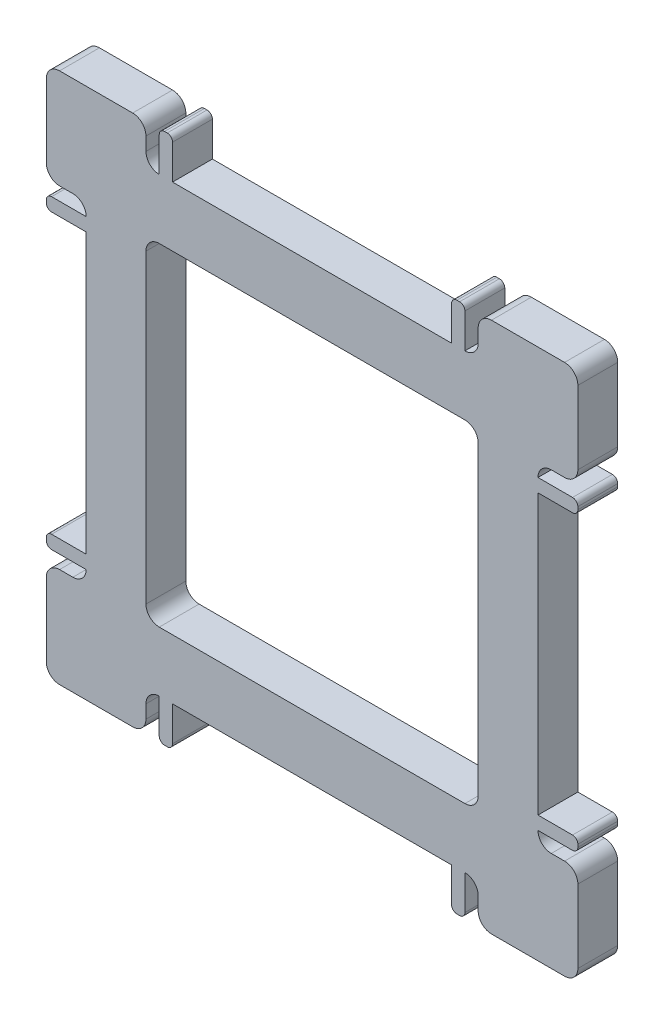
from build123d import *

# Parameters (mm, degrees)
BOSS_EXTRUDE1_DEPTH = 3
BOSS_EXTRUDE2_DEPTH = 3


with BuildPart() as part:
    # Sketch1 → Boss-Extrude1 (new body)
    with BuildSketch(Plane.XY):
        with BuildLine():
            Line((-19, 20), (-13.5, 20))
            ThreePointArc((-13.5, 20), (-12.792893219, 19.707106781), (-12.5, 19))
            Line((-12.5, 19), (-12.5, 18))
            ThreePointArc((-12.5, 18), (-12.207106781, 17.292893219), (-11.5, 17))
            Line((-11.5, 17), (11.5, 17))
            ThreePointArc((11.5, 17), (12.207106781, 17.292893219), (12.5, 18))
            Line((12.5, 18), (12.5, 19))
            ThreePointArc((12.5, 19), (12.792893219, 19.707106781), (13.5, 20))
            Line((13.5, 20), (19, 20))
            ThreePointArc((19, 20), (19.707106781, 19.707106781), (20, 19))
            Line((20, 19), (20, 13.5))
            ThreePointArc((20, 13.5), (19.707106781, 12.792893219), (19, 12.5))
            Line((19, 12.5), (18, 12.5))
            ThreePointArc((18, 12.5), (17.292893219, 12.207106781), (17, 11.5))
            Line((17, 11.5), (17, -11.5))
            ThreePointArc((17, -11.5), (17.292893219, -12.207106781), (18, -12.5))
            Line((18, -12.5), (19, -12.5))
            ThreePointArc((19, -12.5), (19.707106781, -12.792893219), (20, -13.5))
            Line((20, -13.5), (20, -19))
            ThreePointArc((20, -19), (19.707106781, -19.707106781), (19, -20))
            Line((19, -20), (13.5, -20))
            ThreePointArc((13.5, -20), (12.792893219, -19.707106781), (12.5, -19))
            Line((12.5, -19), (12.5, -18))
            ThreePointArc((12.5, -18), (12.207106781, -17.292893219), (11.5, -17))
            Line((11.5, -17), (-11.5, -17))
            ThreePointArc((-11.5, -17), (-12.207106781, -17.292893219), (-12.5, -18))
            Line((-12.5, -18), (-12.5, -19))
            ThreePointArc((-12.5, -19), (-12.792893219, -19.707106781), (-13.5, -20))
            Line((-13.5, -20), (-19, -20))
            ThreePointArc((-19, -20), (-19.707106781, -19.707106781), (-20, -19))
            Line((-20, -19), (-20, -13.5))
            ThreePointArc((-20, -13.5), (-19.707106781, -12.792893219), (-19, -12.5))
            Line((-19, -12.5), (-18, -12.5))
            ThreePointArc((-18, -12.5), (-17.292893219, -12.207106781), (-17, -11.5))
            Line((-17, -11.5), (-17, 11.5))
            ThreePointArc((-17, 11.5), (-17.292893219, 12.207106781), (-18, 12.5))
            Line((-18, 12.5), (-19, 12.5))
            ThreePointArc((-19, 12.5), (-19.707106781, 12.792893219), (-20, 13.5))
            Line((-20, 13.5), (-20, 19))
            ThreePointArc((-20, 19), (-19.707106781, 19.707106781), (-19, 20))
        make_face()
        with BuildLine():
            Line((-11.5, 12.5), (11.5, 12.5))
            ThreePointArc((11.5, 12.5), (12.207106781, 12.207106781), (12.5, 11.5))
            Line((12.5, 11.5), (12.5, -11.5))
            ThreePointArc((12.5, -11.5), (12.207106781, -12.207106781), (11.5, -12.5))
            Line((11.5, -12.5), (-11.5, -12.5))
            ThreePointArc((-11.5, -12.5), (-12.207106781, -12.207106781), (-12.5, -11.5))
            Line((-12.5, -11.5), (-12.5, 11.5))
            ThreePointArc((-12.5, 11.5), (-12.207106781, 12.207106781), (-11.5, 12.5))
        make_face(mode=Mode.SUBTRACT)
    extrude(amount=BOSS_EXTRUDE1_DEPTH)

    # Sketch2 → Boss-Extrude2 (add)
    with BuildSketch(Plane.XY.offset(3)):
        with BuildLine():
            Line((-11.5, 17), (-10.5, 17))
            Line((-10.5, 17), (-10.5, 19.6))
            ThreePointArc((-10.5, 19.6), (-10.617157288, 19.882842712), (-10.9, 20))
            Line((-10.9, 20), (-11.1, 20))
            ThreePointArc((-11.1, 20), (-11.382842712, 19.882842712), (-11.5, 19.6))
            Line((-11.5, 19.6), (-11.5, 17))
        make_face()
        with BuildLine():
            Line((10.5, 17), (11.5, 17))
            Line((11.5, 17), (11.5, 19.6))
            ThreePointArc((11.5, 19.6), (11.382842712, 19.882842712), (11.1, 20))
            Line((11.1, 20), (10.9, 20))
            ThreePointArc((10.9, 20), (10.617157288, 19.882842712), (10.5, 19.6))
            Line((10.5, 19.6), (10.5, 17))
        make_face()
        with BuildLine():
            Line((17, 11.5), (17, 10.5))
            Line((17, 10.5), (19.6, 10.5))
            ThreePointArc((19.6, 10.5), (19.882842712, 10.617157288), (20, 10.9))
            Line((20, 10.9), (20, 11.1))
            ThreePointArc((20, 11.1), (19.882842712, 11.382842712), (19.6, 11.5))
            Line((19.6, 11.5), (17, 11.5))
        make_face()
        with BuildLine():
            Line((17, -10.5), (17, -11.5))
            Line((17, -11.5), (19.6, -11.5))
            ThreePointArc((19.6, -11.5), (19.882842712, -11.382842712), (20, -11.1))
            Line((20, -11.1), (20, -10.9))
            ThreePointArc((20, -10.9), (19.882842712, -10.617157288), (19.6, -10.5))
            Line((19.6, -10.5), (17, -10.5))
        make_face()
        with BuildLine():
            Line((11.5, -17), (10.5, -17))
            Line((10.5, -17), (10.5, -19.6))
            ThreePointArc((10.5, -19.6), (10.617157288, -19.882842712), (10.9, -20))
            Line((10.9, -20), (11.1, -20))
            ThreePointArc((11.1, -20), (11.382842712, -19.882842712), (11.5, -19.6))
            Line((11.5, -19.6), (11.5, -17))
        make_face()
        with BuildLine():
            Line((-10.5, -17), (-11.5, -17))
            Line((-11.5, -17), (-11.5, -19.6))
            ThreePointArc((-11.5, -19.6), (-11.382842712, -19.882842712), (-11.1, -20))
            Line((-11.1, -20), (-10.9, -20))
            ThreePointArc((-10.9, -20), (-10.617157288, -19.882842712), (-10.5, -19.6))
            Line((-10.5, -19.6), (-10.5, -17))
        make_face()
        with BuildLine():
            Line((-17, -11.5), (-17, -10.5))
            Line((-17, -10.5), (-19.6, -10.5))
            ThreePointArc((-19.6, -10.5), (-19.882842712, -10.617157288), (-20, -10.9))
            Line((-20, -10.9), (-20, -11.1))
            ThreePointArc((-20, -11.1), (-19.882842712, -11.382842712), (-19.6, -11.5))
            Line((-19.6, -11.5), (-17, -11.5))
        make_face()
        with BuildLine():
            Line((-17, 10.5), (-17, 11.5))
            Line((-17, 11.5), (-19.6, 11.5))
            ThreePointArc((-19.6, 11.5), (-19.882842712, 11.382842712), (-20, 11.1))
            Line((-20, 11.1), (-20, 10.9))
            ThreePointArc((-20, 10.9), (-19.882842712, 10.617157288), (-19.6, 10.5))
            Line((-19.6, 10.5), (-17, 10.5))
        make_face()
    extrude(amount=-BOSS_EXTRUDE2_DEPTH)


solid = part.part
